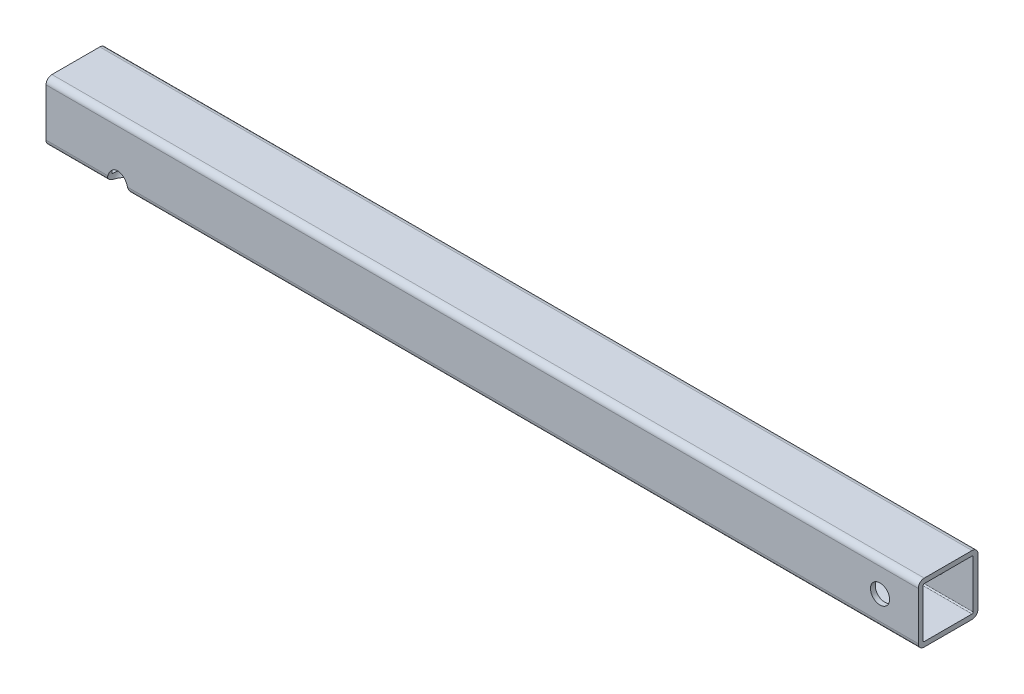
from build123d import *

# Parameters (mm, degrees)
BOSS_EXTRU_1_DEPTH      = 365
ESQUISSE2_R             = 4
ENL_V_MAT_EXTRU_1_DEPTH = 367.068641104
ENL_V_MAT_EXTRU_2_REACH = 368.61
ESQUISSE3_R             = 4.5


with BuildPart() as part:
    # Esquisse1 → Boss.-Extru.1 (new body)
    with BuildSketch(Plane(origin=(0, 0, 0), x_dir=(0, 0, -1), z_dir=(1, 0, 0))):
        with BuildLine():
            Line((-10, 12.5), (10, 12.5))
            ThreePointArc((10, 12.5), (11.767766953, 11.767766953), (12.5, 10))
            Line((12.5, 10), (12.5, -10))
            ThreePointArc((12.5, -10), (11.767766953, -11.767766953), (10, -12.5))
            Line((10, -12.5), (-10, -12.5))
            ThreePointArc((-10, -12.5), (-11.767766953, -11.767766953), (-12.5, -10))
            Line((-12.5, -10), (-12.5, 10))
            ThreePointArc((-12.5, 10), (-11.767766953, 11.767766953), (-10, 12.5))
        make_face()
        with BuildLine():
            Line((-10, 10.5), (10, 10.5))
            ThreePointArc((10, 10.5), (10.353553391, 10.353553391), (10.5, 10))
            Line((10.5, 10), (10.5, -10))
            ThreePointArc((10.5, -10), (10.353553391, -10.353553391), (10, -10.5))
            Line((10, -10.5), (-10, -10.5))
            ThreePointArc((-10, -10.5), (-10.353553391, -10.353553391), (-10.5, -10))
            Line((-10.5, -10), (-10.5, 10))
            ThreePointArc((-10.5, 10), (-10.353553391, 10.353553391), (-10, 10.5))
        make_face(mode=Mode.SUBTRACT)
    extrude(amount=BOSS_EXTRU_1_DEPTH)

    # Esquisse2 → Enl_v. mat.-Extru.1 (cut, through all)
    with BuildSketch(Plane.XY.offset(12.5)):
        with Locations((349, 0)):
            Circle(ESQUISSE2_R)
    extrude(amount=-ENL_V_MAT_EXTRU_1_DEPTH, mode=Mode.SUBTRACT)

    # Esquisse3 → Enl_v. mat.-Extru.2 (cut, up to next)
    with BuildSketch(Plane(origin=(0, -11.767766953, 11.767766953), x_dir=(-1, 0, 0), z_dir=(0, -0.7071067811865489, 0.7071067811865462)), mode=Mode.PRIVATE) as enl_v_mat_extru_2_sk1:
        with Locations(Location((-30, 0, 0), (0, 0, 23.131147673))):
            Circle(ESQUISSE3_R)
    enl_v_mat_extru_2_tool1 = extrude(enl_v_mat_extru_2_sk1.sketch, amount=-ENL_V_MAT_EXTRU_2_REACH, mode=Mode.PRIVATE) & part.part
    add(enl_v_mat_extru_2_tool1.solids().sort_by_distance((30, -11.767767, 11.767767))[0], mode=Mode.SUBTRACT)


solid = part.part
